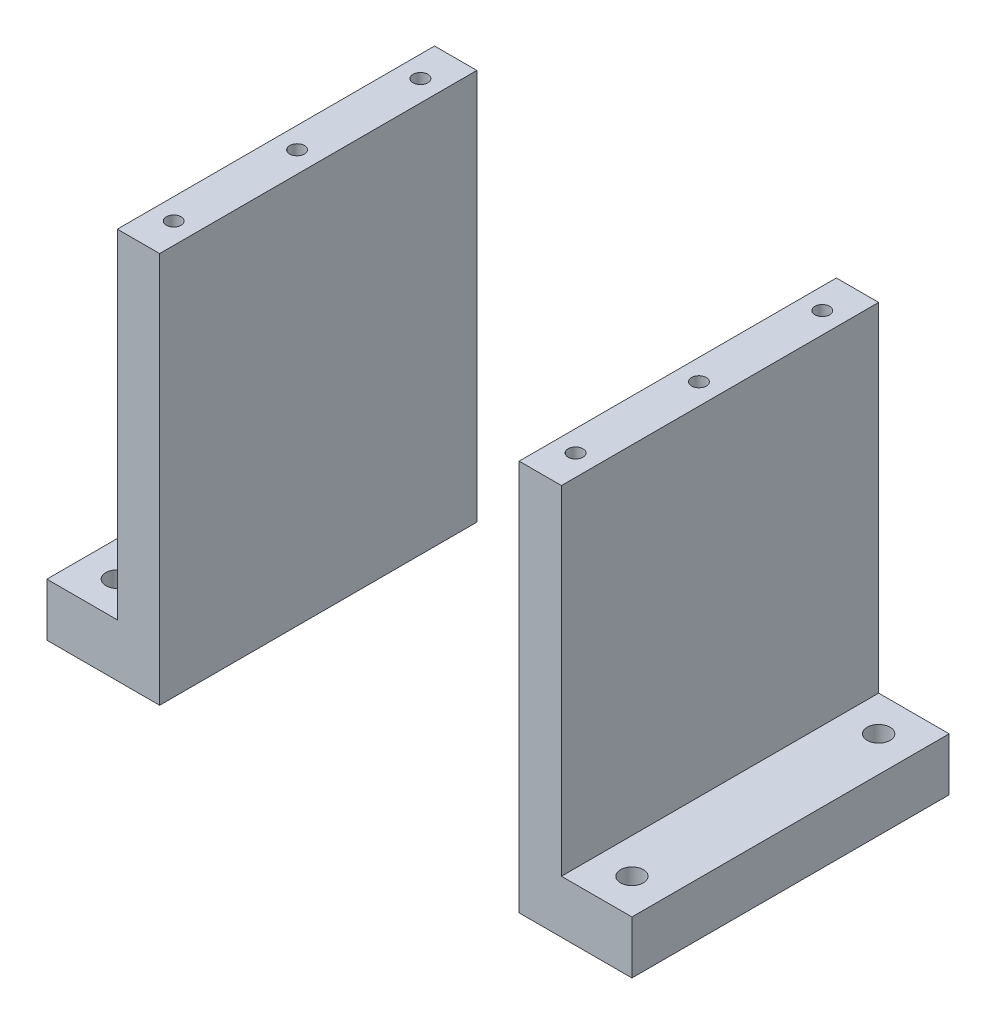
from build123d import *

# Parameters (mm, degrees)
EXTRUDE_1_DEPTH     = 90
EXTRUDE_1_2_DEPTH   = 90
SKETCH_2_R          = 3.25
CUT_EXTRUDE_1_DEPTH = 90
SKETCH_3_R          = 2.1
CUT_EXTRUDE_2_DEPTH = 15


with BuildPart() as part:
    # Sketch 1 → Extrude 1 (new body)
    with BuildSketch(Plane.XY):
        Polygon((20, 15), (20, 111), (32, 111), (32, 0), (0, 0), (0, 15), align=None)
    extrude(amount=EXTRUDE_1_DEPTH)


with BuildPart() as body_2:
    # Sketch 1 → Extrude 1 2 (new body)
    with BuildSketch(Plane.XY):
        Polygon((134, 0), (134, 111), (146, 111), (146, 15), (166, 15), (166, 0), align=None)
    extrude(amount=EXTRUDE_1_2_DEPTH)


with BuildPart() as cut_extrude_1_tool:
    # Sketch 2 → Cut-Extrude 1 (new body)
    with BuildSketch(Plane(origin=(0, 15, 0), x_dir=(1, 0, 0), z_dir=(0, 1, 0))):
        with Locations(Location((10, -10, 0), (0, 0, 270))):
            Circle(SKETCH_2_R)
        with Locations(Location((10, -80, 0), (0, 0, 270))):
            Circle(SKETCH_2_R)
        with Locations(Location((156, -80, 0), (0, 0, 270))):
            Circle(SKETCH_2_R)
        with Locations(Location((156, -10, 0), (0, 0, 270))):
            Circle(SKETCH_2_R)
    extrude(amount=-CUT_EXTRUDE_1_DEPTH)


with BuildPart() as part_1:
    add(part.part)

    # Cut-Extrude 1: cut by cut_extrude_1_tool
    add(cut_extrude_1_tool.part, mode=Mode.SUBTRACT)


with BuildPart() as body_2_1:
    add(body_2.part)

    # Cut-Extrude 1: cut by cut_extrude_1_tool
    add(cut_extrude_1_tool.part, mode=Mode.SUBTRACT)


with BuildPart() as cut_extrude_2_tool:
    # Sketch 3 → Cut-Extrude 2 (new body)
    with BuildSketch(Plane(origin=(0, 111, 0), x_dir=(1, 0, 0), z_dir=(0, 1, 0))):
        with Locations(Location((26, -10, 0), (0, 0, 270))):
            Circle(SKETCH_3_R)
        with Locations(Location((26, -45, 0), (0, 0, 270))):
            Circle(SKETCH_3_R)
        with Locations(Location((26, -80, 0), (0, 0, 270))):
            Circle(SKETCH_3_R)
        with Locations(Location((140, -80, 0), (0, 0, 270))):
            Circle(SKETCH_3_R)
        with Locations(Location((140, -45, 0), (0, 0, 270))):
            Circle(SKETCH_3_R)
        with Locations(Location((140, -10, 0), (0, 0, 270))):
            Circle(SKETCH_3_R)
    extrude(amount=-CUT_EXTRUDE_2_DEPTH)


with BuildPart() as part_2:
    add(part_1.part)

    # Cut-Extrude 2: cut by cut_extrude_2_tool
    add(cut_extrude_2_tool.part, mode=Mode.SUBTRACT)


with BuildPart() as body_2_2:
    add(body_2_1.part)

    # Cut-Extrude 2: cut by cut_extrude_2_tool
    add(cut_extrude_2_tool.part, mode=Mode.SUBTRACT)


solid = Compound([part_2.part, body_2_2.part])
